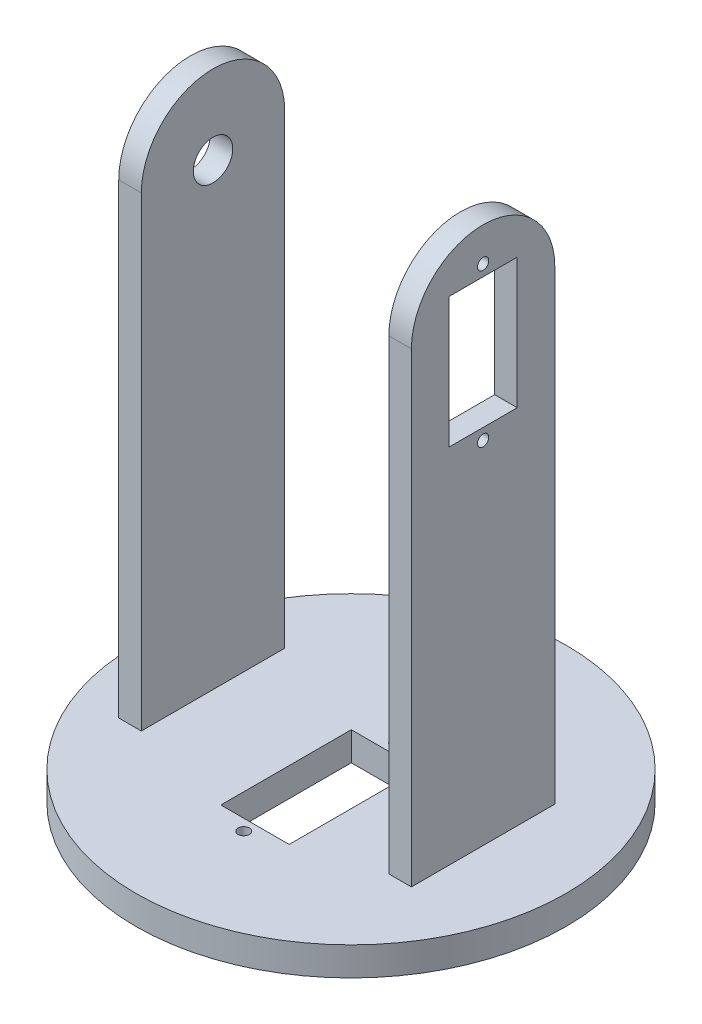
ISO-10303-21;
HEADER;
FILE_DESCRIPTION(('STEP AP214'),'2;1');
FILE_NAME('part.step','',(''),(''),'','','');
FILE_SCHEMA(('AUTOMOTIVE_DESIGN { 1 0 10303 214 1 1 1 1 }'));
ENDSEC;
DATA;
#1=APPLICATION_CONTEXT('core data for automotive mechanical design processes');
#2=APPLICATION_PROTOCOL_DEFINITION('international standard','automotive_design',2000,#1);
#3=PRODUCT_CONTEXT('',#1,'mechanical');
#4=PRODUCT('Part','Part','',(#3));
#5=PRODUCT_RELATED_PRODUCT_CATEGORY('part','',(#4));
#6=PRODUCT_DEFINITION_FORMATION('','',#4);
#7=PRODUCT_DEFINITION_CONTEXT('part definition',#1,'design');
#8=PRODUCT_DEFINITION('design','',#6,#7);
#9=PRODUCT_DEFINITION_SHAPE('','',#8);
#10=(LENGTH_UNIT() NAMED_UNIT(*) SI_UNIT(.MILLI.,.METRE.));
#11=(NAMED_UNIT(*) PLANE_ANGLE_UNIT() SI_UNIT($,.RADIAN.));
#12=(NAMED_UNIT(*) SI_UNIT($,.STERADIAN.) SOLID_ANGLE_UNIT());
#13=UNCERTAINTY_MEASURE_WITH_UNIT(LENGTH_MEASURE(1.E-05),#10,'distance_accuracy_value','');
#14=(GEOMETRIC_REPRESENTATION_CONTEXT(3) GLOBAL_UNCERTAINTY_ASSIGNED_CONTEXT((#13)) GLOBAL_UNIT_ASSIGNED_CONTEXT((#10,
#11,#12)) REPRESENTATION_CONTEXT('',''));
#15=CARTESIAN_POINT('',(0.,0.,0.));
#16=DIRECTION('',(0.,0.,1.));
#17=DIRECTION('',(1.,0.,0.));
#18=AXIS2_PLACEMENT_3D('',#15,#16,#17);
#19=CARTESIAN_POINT('',(-28.448,100.33,-12.7));
#20=DIRECTION('',(1.,0.,0.));
#21=DIRECTION('',(0.,0.,-1.));
#22=AXIS2_PLACEMENT_3D('',#19,#20,#21);
#23=PLANE('',#22);
#24=CARTESIAN_POINT('',(-28.448,86.33,0.));
#25=DIRECTION('',(-1.,0.,0.));
#26=DIRECTION('',(0.,0.,1.));
#27=AXIS2_PLACEMENT_3D('',#24,#25,#26);
#28=CIRCLE('',#27,3.5);
#29=CARTESIAN_POINT('',(-28.448,86.33,3.5));
#30=VERTEX_POINT('',#29);
#31=EDGE_CURVE('E164',#30,#30,#28,.T.);
#32=ORIENTED_EDGE('',*,*,#31,.F.);
#33=EDGE_LOOP('',(#32));
#34=FACE_BOUND('',#33,.T.);
#35=CARTESIAN_POINT('',(-28.448,87.63,0.));
#36=DIRECTION('',(1.,0.,0.));
#37=DIRECTION('',(0.,0.,-1.));
#38=AXIS2_PLACEMENT_3D('',#35,#36,#37);
#39=CIRCLE('',#38,12.7);
#40=CARTESIAN_POINT('',(-28.448,87.63,12.7));
#41=VERTEX_POINT('',#40);
#42=CARTESIAN_POINT('',(-28.448,87.63,-12.7));
#43=VERTEX_POINT('',#42);
#44=EDGE_CURVE('E206',#41,#43,#39,.F.);
#45=ORIENTED_EDGE('',*,*,#44,.T.);
#46=DIRECTION('',(0.,-1.,0.));
#47=VECTOR('',#46,1.);
#48=CARTESIAN_POINT('',(-28.448,100.33,-12.7));
#49=LINE('',#48,#47);
#50=CARTESIAN_POINT('',(-28.448,5.08,-12.7));
#51=VERTEX_POINT('',#50);
#52=EDGE_CURVE('E283',#43,#51,#49,.T.);
#53=ORIENTED_EDGE('',*,*,#52,.T.);
#54=DIRECTION('',(0.,0.,1.));
#55=VECTOR('',#54,1.);
#56=CARTESIAN_POINT('',(-28.448,5.08,-12.7));
#57=LINE('',#56,#55);
#58=CARTESIAN_POINT('',(-28.448,5.08,12.7));
#59=VERTEX_POINT('',#58);
#60=EDGE_CURVE('E271',#51,#59,#57,.T.);
#61=ORIENTED_EDGE('',*,*,#60,.T.);
#62=DIRECTION('',(0.,-1.,0.));
#63=VECTOR('',#62,1.);
#64=CARTESIAN_POINT('',(-28.448,100.33,12.7));
#65=LINE('',#64,#63);
#66=EDGE_CURVE('E289',#41,#59,#65,.T.);
#67=ORIENTED_EDGE('',*,*,#66,.F.);
#68=EDGE_LOOP('',(#45,#53,#61,#67));
#69=FACE_BOUND('',#68,.T.);
#70=ADVANCED_FACE('F37',(#34,#69),#23,.F.);
#71=CARTESIAN_POINT('',(-24.448,100.33,-12.7));
#72=DIRECTION('',(-1.,0.,0.));
#73=DIRECTION('',(0.,0.,1.));
#74=AXIS2_PLACEMENT_3D('',#71,#72,#73);
#75=PLANE('',#74);
#76=CARTESIAN_POINT('',(-24.448,86.33,0.));
#77=DIRECTION('',(-1.,0.,0.));
#78=DIRECTION('',(0.,0.,1.));
#79=AXIS2_PLACEMENT_3D('',#76,#77,#78);
#80=CIRCLE('',#79,3.5);
#81=CARTESIAN_POINT('',(-24.448,86.33,3.5));
#82=VERTEX_POINT('',#81);
#83=EDGE_CURVE('E189',#82,#82,#80,.F.);
#84=ORIENTED_EDGE('',*,*,#83,.F.);
#85=EDGE_LOOP('',(#84));
#86=FACE_BOUND('',#85,.T.);
#87=DIRECTION('',(0.,-1.,0.));
#88=VECTOR('',#87,1.);
#89=CARTESIAN_POINT('',(-24.448,100.33,-12.7));
#90=LINE('',#89,#88);
#91=CARTESIAN_POINT('',(-24.448,87.63,-12.7));
#92=VERTEX_POINT('',#91);
#93=CARTESIAN_POINT('',(-24.448,5.08,-12.7));
#94=VERTEX_POINT('',#93);
#95=EDGE_CURVE('E285',#92,#94,#90,.T.);
#96=ORIENTED_EDGE('',*,*,#95,.F.);
#97=CARTESIAN_POINT('',(-24.448,87.63,0.));
#98=DIRECTION('',(-1.,0.,0.));
#99=DIRECTION('',(0.,0.,1.));
#100=AXIS2_PLACEMENT_3D('',#97,#98,#99);
#101=CIRCLE('',#100,12.7);
#102=CARTESIAN_POINT('',(-24.448,87.63,12.7));
#103=VERTEX_POINT('',#102);
#104=EDGE_CURVE('E203',#92,#103,#101,.F.);
#105=ORIENTED_EDGE('',*,*,#104,.T.);
#106=DIRECTION('',(0.,-1.,0.));
#107=VECTOR('',#106,1.);
#108=CARTESIAN_POINT('',(-24.448,100.33,12.7));
#109=LINE('',#108,#107);
#110=CARTESIAN_POINT('',(-24.448,5.08,12.7));
#111=VERTEX_POINT('',#110);
#112=EDGE_CURVE('E287',#103,#111,#109,.T.);
#113=ORIENTED_EDGE('',*,*,#112,.T.);
#114=DIRECTION('',(0.,0.,-1.));
#115=VECTOR('',#114,1.);
#116=CARTESIAN_POINT('',(-24.448,5.08,-12.7));
#117=LINE('',#116,#115);
#118=EDGE_CURVE('E277',#111,#94,#117,.T.);
#119=ORIENTED_EDGE('',*,*,#118,.T.);
#120=EDGE_LOOP('',(#96,#105,#113,#119));
#121=FACE_BOUND('',#120,.T.);
#122=ADVANCED_FACE('F311',(#86,#121),#75,.F.);
#123=CARTESIAN_POINT('',(19.4,100.33,-12.7));
#124=DIRECTION('',(1.,0.,0.));
#125=DIRECTION('',(0.,0.,-1.));
#126=AXIS2_PLACEMENT_3D('',#123,#124,#125);
#127=PLANE('',#126);
#128=CARTESIAN_POINT('',(19.4,94.33,0.));
#129=DIRECTION('',(1.,0.,0.));
#130=DIRECTION('',(0.,0.,-1.));
#131=AXIS2_PLACEMENT_3D('',#128,#129,#130);
#132=CIRCLE('',#131,1.);
#133=CARTESIAN_POINT('',(19.4,94.33,-0.999999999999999));
#134=VERTEX_POINT('',#133);
#135=EDGE_CURVE('E208',#134,#134,#132,.F.);
#136=ORIENTED_EDGE('',*,*,#135,.F.);
#137=EDGE_LOOP('',(#136));
#138=FACE_BOUND('',#137,.T.);
#139=CARTESIAN_POINT('',(19.4,67.23,0.));
#140=DIRECTION('',(1.,0.,0.));
#141=DIRECTION('',(0.,0.,-1.));
#142=AXIS2_PLACEMENT_3D('',#139,#140,#141);
#143=CIRCLE('',#142,1.);
#144=CARTESIAN_POINT('',(19.4,67.23,-1.));
#145=VERTEX_POINT('',#144);
#146=EDGE_CURVE('E209',#145,#145,#143,.F.);
#147=ORIENTED_EDGE('',*,*,#146,.F.);
#148=EDGE_LOOP('',(#147));
#149=FACE_BOUND('',#148,.T.);
#150=DIRECTION('',(0.,1.,0.));
#151=VECTOR('',#150,1.);
#152=CARTESIAN_POINT('',(19.4,92.33,6.05));
#153=LINE('',#152,#151);
#154=CARTESIAN_POINT('',(19.4,69.23,6.05));
#155=VERTEX_POINT('',#154);
#156=CARTESIAN_POINT('',(19.4,92.33,6.05));
#157=VERTEX_POINT('',#156);
#158=EDGE_CURVE('E222',#155,#157,#153,.T.);
#159=ORIENTED_EDGE('',*,*,#158,.F.);
#160=DIRECTION('',(0.,0.,1.));
#161=VECTOR('',#160,1.);
#162=CARTESIAN_POINT('',(19.4,69.23,6.05));
#163=LINE('',#162,#161);
#164=CARTESIAN_POINT('',(19.4,69.23,-6.05));
#165=VERTEX_POINT('',#164);
#166=EDGE_CURVE('E216',#165,#155,#163,.T.);
#167=ORIENTED_EDGE('',*,*,#166,.F.);
#168=DIRECTION('',(0.,-1.,0.));
#169=VECTOR('',#168,1.);
#170=CARTESIAN_POINT('',(19.4,92.33,-6.05));
#171=LINE('',#170,#169);
#172=CARTESIAN_POINT('',(19.4,92.33,-6.05));
#173=VERTEX_POINT('',#172);
#174=EDGE_CURVE('E235',#173,#165,#171,.T.);
#175=ORIENTED_EDGE('',*,*,#174,.F.);
#176=DIRECTION('',(0.,0.,-1.));
#177=VECTOR('',#176,1.);
#178=CARTESIAN_POINT('',(19.4,92.33,6.05));
#179=LINE('',#178,#177);
#180=EDGE_CURVE('E238',#157,#173,#179,.T.);
#181=ORIENTED_EDGE('',*,*,#180,.F.);
#182=EDGE_LOOP('',(#159,#167,#175,#181));
#183=FACE_BOUND('',#182,.T.);
#184=CARTESIAN_POINT('',(19.4,87.63,0.));
#185=DIRECTION('',(1.,0.,0.));
#186=DIRECTION('',(0.,0.,-1.));
#187=AXIS2_PLACEMENT_3D('',#184,#185,#186);
#188=CIRCLE('',#187,12.7);
#189=CARTESIAN_POINT('',(19.4,87.63,12.7));
#190=VERTEX_POINT('',#189);
#191=CARTESIAN_POINT('',(19.4,87.63,-12.7));
#192=VERTEX_POINT('',#191);
#193=EDGE_CURVE('E201',#190,#192,#188,.F.);
#194=ORIENTED_EDGE('',*,*,#193,.T.);
#195=DIRECTION('',(0.,-1.,0.));
#196=VECTOR('',#195,1.);
#197=CARTESIAN_POINT('',(19.4,100.33,-12.7));
#198=LINE('',#197,#196);
#199=CARTESIAN_POINT('',(19.4,5.08,-12.7));
#200=VERTEX_POINT('',#199);
#201=EDGE_CURVE('E263',#192,#200,#198,.T.);
#202=ORIENTED_EDGE('',*,*,#201,.T.);
#203=DIRECTION('',(0.,0.,1.));
#204=VECTOR('',#203,1.);
#205=CARTESIAN_POINT('',(19.4,5.08,-12.7));
#206=LINE('',#205,#204);
#207=CARTESIAN_POINT('',(19.4,5.08,12.7));
#208=VERTEX_POINT('',#207);
#209=EDGE_CURVE('E251',#200,#208,#206,.T.);
#210=ORIENTED_EDGE('',*,*,#209,.T.);
#211=DIRECTION('',(0.,-1.,0.));
#212=VECTOR('',#211,1.);
#213=CARTESIAN_POINT('',(19.4,100.33,12.7));
#214=LINE('',#213,#212);
#215=EDGE_CURVE('E269',#190,#208,#214,.T.);
#216=ORIENTED_EDGE('',*,*,#215,.F.);
#217=EDGE_LOOP('',(#194,#202,#210,#216));
#218=FACE_BOUND('',#217,.T.);
#219=ADVANCED_FACE('F317',(#138,#149,#183,#218),#127,.F.);
#220=CARTESIAN_POINT('',(23.4,100.33,-12.7));
#221=DIRECTION('',(-1.,0.,0.));
#222=DIRECTION('',(0.,0.,1.));
#223=AXIS2_PLACEMENT_3D('',#220,#221,#222);
#224=PLANE('',#223);
#225=CARTESIAN_POINT('',(23.4,94.33,0.));
#226=DIRECTION('',(1.,0.,0.));
#227=DIRECTION('',(0.,0.,-1.));
#228=AXIS2_PLACEMENT_3D('',#225,#226,#227);
#229=CIRCLE('',#228,1.);
#230=CARTESIAN_POINT('',(23.4,94.33,-0.999999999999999));
#231=VERTEX_POINT('',#230);
#232=EDGE_CURVE('E213',#231,#231,#229,.T.);
#233=ORIENTED_EDGE('',*,*,#232,.F.);
#234=EDGE_LOOP('',(#233));
#235=FACE_BOUND('',#234,.T.);
#236=CARTESIAN_POINT('',(23.4,67.23,0.));
#237=DIRECTION('',(1.,0.,0.));
#238=DIRECTION('',(0.,0.,-1.));
#239=AXIS2_PLACEMENT_3D('',#236,#237,#238);
#240=CIRCLE('',#239,1.);
#241=CARTESIAN_POINT('',(23.4,67.23,-1.));
#242=VERTEX_POINT('',#241);
#243=EDGE_CURVE('E212',#242,#242,#240,.T.);
#244=ORIENTED_EDGE('',*,*,#243,.F.);
#245=EDGE_LOOP('',(#244));
#246=FACE_BOUND('',#245,.T.);
#247=DIRECTION('',(0.,1.,0.));
#248=VECTOR('',#247,1.);
#249=CARTESIAN_POINT('',(23.4,92.33,-6.05));
#250=LINE('',#249,#248);
#251=CARTESIAN_POINT('',(23.4,69.23,-6.05));
#252=VERTEX_POINT('',#251);
#253=CARTESIAN_POINT('',(23.4,92.33,-6.05));
#254=VERTEX_POINT('',#253);
#255=EDGE_CURVE('E226',#252,#254,#250,.T.);
#256=ORIENTED_EDGE('',*,*,#255,.F.);
#257=DIRECTION('',(0.,0.,-1.));
#258=VECTOR('',#257,1.);
#259=CARTESIAN_POINT('',(23.4,69.23,6.05));
#260=LINE('',#259,#258);
#261=CARTESIAN_POINT('',(23.4,69.23,6.05));
#262=VERTEX_POINT('',#261);
#263=EDGE_CURVE('E229',#262,#252,#260,.T.);
#264=ORIENTED_EDGE('',*,*,#263,.F.);
#265=DIRECTION('',(0.,-1.,0.));
#266=VECTOR('',#265,1.);
#267=CARTESIAN_POINT('',(23.4,92.33,6.05));
#268=LINE('',#267,#266);
#269=CARTESIAN_POINT('',(23.4,92.33,6.05));
#270=VERTEX_POINT('',#269);
#271=EDGE_CURVE('E232',#270,#262,#268,.T.);
#272=ORIENTED_EDGE('',*,*,#271,.F.);
#273=DIRECTION('',(0.,0.,1.));
#274=VECTOR('',#273,1.);
#275=CARTESIAN_POINT('',(23.4,92.33,6.05));
#276=LINE('',#275,#274);
#277=EDGE_CURVE('E223',#254,#270,#276,.T.);
#278=ORIENTED_EDGE('',*,*,#277,.F.);
#279=EDGE_LOOP('',(#256,#264,#272,#278));
#280=FACE_BOUND('',#279,.T.);
#281=DIRECTION('',(0.,-1.,0.));
#282=VECTOR('',#281,1.);
#283=CARTESIAN_POINT('',(23.4,100.33,-12.7));
#284=LINE('',#283,#282);
#285=CARTESIAN_POINT('',(23.4,87.63,-12.7));
#286=VERTEX_POINT('',#285);
#287=CARTESIAN_POINT('',(23.4,5.08,-12.7));
#288=VERTEX_POINT('',#287);
#289=EDGE_CURVE('E265',#286,#288,#284,.T.);
#290=ORIENTED_EDGE('',*,*,#289,.F.);
#291=CARTESIAN_POINT('',(23.4,87.63,0.));
#292=DIRECTION('',(1.,0.,0.));
#293=DIRECTION('',(0.,0.,-1.));
#294=AXIS2_PLACEMENT_3D('',#291,#292,#293);
#295=CIRCLE('',#294,12.7);
#296=CARTESIAN_POINT('',(23.4,87.63,12.7));
#297=VERTEX_POINT('',#296);
#298=EDGE_CURVE('E196',#297,#286,#295,.F.);
#299=ORIENTED_EDGE('',*,*,#298,.F.);
#300=DIRECTION('',(0.,-1.,0.));
#301=VECTOR('',#300,1.);
#302=CARTESIAN_POINT('',(23.4,100.33,12.7));
#303=LINE('',#302,#301);
#304=CARTESIAN_POINT('',(23.4,5.08,12.7));
#305=VERTEX_POINT('',#304);
#306=EDGE_CURVE('E267',#297,#305,#303,.T.);
#307=ORIENTED_EDGE('',*,*,#306,.T.);
#308=DIRECTION('',(0.,0.,-1.));
#309=VECTOR('',#308,1.);
#310=CARTESIAN_POINT('',(23.4,5.08,-12.7));
#311=LINE('',#310,#309);
#312=EDGE_CURVE('E257',#305,#288,#311,.T.);
#313=ORIENTED_EDGE('',*,*,#312,.T.);
#314=EDGE_LOOP('',(#290,#299,#307,#313));
#315=FACE_BOUND('',#314,.T.);
#316=ADVANCED_FACE('F361',(#235,#246,#280,#315),#224,.F.);
#317=CARTESIAN_POINT('',(-28.448,100.33,-12.7));
#318=DIRECTION('',(0.,0.,1.));
#319=DIRECTION('',(1.,0.,0.));
#320=AXIS2_PLACEMENT_3D('',#317,#318,#319);
#321=PLANE('',#320);
#322=DIRECTION('',(1.,0.,0.));
#323=VECTOR('',#322,1.);
#324=CARTESIAN_POINT('',(-38.1,87.63,-12.7));
#325=LINE('',#324,#323);
#326=EDGE_CURVE('E195',#43,#92,#325,.T.);
#327=ORIENTED_EDGE('',*,*,#326,.T.);
#328=ORIENTED_EDGE('',*,*,#95,.T.);
#329=DIRECTION('',(-1.,0.,0.));
#330=VECTOR('',#329,1.);
#331=CARTESIAN_POINT('',(-28.448,5.08,-12.7));
#332=LINE('',#331,#330);
#333=EDGE_CURVE('E280',#94,#51,#332,.T.);
#334=ORIENTED_EDGE('',*,*,#333,.T.);
#335=ORIENTED_EDGE('',*,*,#52,.F.);
#336=EDGE_LOOP('',(#327,#328,#334,#335));
#337=FACE_BOUND('',#336,.T.);
#338=ADVANCED_FACE('F328',(#337),#321,.F.);
#339=CARTESIAN_POINT('',(19.4,100.33,-12.7));
#340=DIRECTION('',(0.,0.,1.));
#341=DIRECTION('',(1.,0.,0.));
#342=AXIS2_PLACEMENT_3D('',#339,#340,#341);
#343=PLANE('',#342);
#344=EDGE_CURVE('E192',#192,#286,#325,.T.);
#345=ORIENTED_EDGE('',*,*,#344,.T.);
#346=ORIENTED_EDGE('',*,*,#289,.T.);
#347=DIRECTION('',(-1.,0.,0.));
#348=VECTOR('',#347,1.);
#349=CARTESIAN_POINT('',(19.4,5.08,-12.7));
#350=LINE('',#349,#348);
#351=EDGE_CURVE('E260',#288,#200,#350,.T.);
#352=ORIENTED_EDGE('',*,*,#351,.T.);
#353=ORIENTED_EDGE('',*,*,#201,.F.);
#354=EDGE_LOOP('',(#345,#346,#352,#353));
#355=FACE_BOUND('',#354,.T.);
#356=ADVANCED_FACE('F323',(#355),#343,.F.);
#357=CARTESIAN_POINT('',(0.,5.08,0.));
#358=DIRECTION('',(0.,1.,0.));
#359=DIRECTION('',(0.,0.,1.));
#360=AXIS2_PLACEMENT_3D('',#357,#358,#359);
#361=PLANE('',#360);
#362=CARTESIAN_POINT('',(0.,5.08,-8.096));
#363=DIRECTION('',(0.,1.,0.));
#364=DIRECTION('',(0.,0.,1.));
#365=AXIS2_PLACEMENT_3D('',#362,#363,#364);
#366=CIRCLE('',#365,1.);
#367=CARTESIAN_POINT('',(0.,5.08,-7.096));
#368=VERTEX_POINT('',#367);
#369=EDGE_CURVE('E334',#368,#368,#366,.T.);
#370=ORIENTED_EDGE('',*,*,#369,.F.);
#371=EDGE_LOOP('',(#370));
#372=FACE_BOUND('',#371,.T.);
#373=CARTESIAN_POINT('',(0.,5.08,19.004));
#374=DIRECTION('',(0.,1.,0.));
#375=DIRECTION('',(0.,0.,1.));
#376=AXIS2_PLACEMENT_3D('',#373,#374,#375);
#377=CIRCLE('',#376,1.);
#378=CARTESIAN_POINT('',(0.,5.08,20.004));
#379=VERTEX_POINT('',#378);
#380=EDGE_CURVE('E338',#379,#379,#377,.T.);
#381=ORIENTED_EDGE('',*,*,#380,.F.);
#382=EDGE_LOOP('',(#381));
#383=FACE_BOUND('',#382,.T.);
#384=DIRECTION('',(0.,0.,1.));
#385=VECTOR('',#384,1.);
#386=CARTESIAN_POINT('',(-6.05,5.08,-6.096));
#387=LINE('',#386,#385);
#388=CARTESIAN_POINT('',(-6.05,5.08,-6.096));
#389=VERTEX_POINT('',#388);
#390=CARTESIAN_POINT('',(-6.05000000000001,5.08,17.004));
#391=VERTEX_POINT('',#390);
#392=EDGE_CURVE('E52',#389,#391,#387,.T.);
#393=ORIENTED_EDGE('',*,*,#392,.F.);
#394=DIRECTION('',(-1.,0.,0.));
#395=VECTOR('',#394,1.);
#396=CARTESIAN_POINT('',(-6.05,5.08,-6.096));
#397=LINE('',#396,#395);
#398=CARTESIAN_POINT('',(6.05,5.08,-6.096));
#399=VERTEX_POINT('',#398);
#400=EDGE_CURVE('E158',#399,#389,#397,.T.);
#401=ORIENTED_EDGE('',*,*,#400,.F.);
#402=DIRECTION('',(0.,0.,-1.));
#403=VECTOR('',#402,1.);
#404=CARTESIAN_POINT('',(6.05,5.08,-6.096));
#405=LINE('',#404,#403);
#406=CARTESIAN_POINT('',(6.04999999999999,5.08,17.004));
#407=VERTEX_POINT('',#406);
#408=EDGE_CURVE('E178',#407,#399,#405,.T.);
#409=ORIENTED_EDGE('',*,*,#408,.F.);
#410=DIRECTION('',(1.,0.,0.));
#411=VECTOR('',#410,1.);
#412=CARTESIAN_POINT('',(-6.05000000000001,5.08,17.004));
#413=LINE('',#412,#411);
#414=EDGE_CURVE('E172',#391,#407,#413,.T.);
#415=ORIENTED_EDGE('',*,*,#414,.F.);
#416=EDGE_LOOP('',(#393,#401,#409,#415));
#417=FACE_BOUND('',#416,.T.);
#418=CARTESIAN_POINT('',(0.,5.08,0.));
#419=DIRECTION('',(0.,1.,0.));
#420=DIRECTION('',(0.,0.,1.));
#421=AXIS2_PLACEMENT_3D('',#418,#419,#420);
#422=CIRCLE('',#421,38.1);
#423=CARTESIAN_POINT('',(0.,5.08,38.1));
#424=VERTEX_POINT('',#423);
#425=EDGE_CURVE('E11',#424,#424,#422,.T.);
#426=ORIENTED_EDGE('',*,*,#425,.T.);
#427=EDGE_LOOP('',(#426));
#428=FACE_BOUND('',#427,.T.);
#429=DIRECTION('',(1.,0.,0.));
#430=VECTOR('',#429,1.);
#431=CARTESIAN_POINT('',(-28.448,5.08,12.7));
#432=LINE('',#431,#430);
#433=EDGE_CURVE('E274',#59,#111,#432,.T.);
#434=ORIENTED_EDGE('',*,*,#433,.F.);
#435=ORIENTED_EDGE('',*,*,#60,.F.);
#436=ORIENTED_EDGE('',*,*,#333,.F.);
#437=ORIENTED_EDGE('',*,*,#118,.F.);
#438=EDGE_LOOP('',(#434,#435,#436,#437));
#439=FACE_BOUND('',#438,.T.);
#440=DIRECTION('',(1.,0.,0.));
#441=VECTOR('',#440,1.);
#442=CARTESIAN_POINT('',(19.4,5.08,12.7));
#443=LINE('',#442,#441);
#444=EDGE_CURVE('E254',#208,#305,#443,.T.);
#445=ORIENTED_EDGE('',*,*,#444,.F.);
#446=ORIENTED_EDGE('',*,*,#209,.F.);
#447=ORIENTED_EDGE('',*,*,#351,.F.);
#448=ORIENTED_EDGE('',*,*,#312,.F.);
#449=EDGE_LOOP('',(#445,#446,#447,#448));
#450=FACE_BOUND('',#449,.T.);
#451=ADVANCED_FACE('F305',(#372,#383,#417,#428,#439,#450),#361,.T.);
#452=CARTESIAN_POINT('',(0.,5.08,0.));
#453=DIRECTION('',(0.,-1.,0.));
#454=DIRECTION('',(0.,0.,-1.));
#455=AXIS2_PLACEMENT_3D('',#452,#453,#454);
#456=CYLINDRICAL_SURFACE('',#455,38.1);
#457=ORIENTED_EDGE('',*,*,#425,.F.);
#458=EDGE_LOOP('',(#457));
#459=FACE_BOUND('',#458,.T.);
#460=CARTESIAN_POINT('',(0.,0.,0.));
#461=DIRECTION('',(0.,1.,0.));
#462=DIRECTION('',(0.,0.,1.));
#463=AXIS2_PLACEMENT_3D('',#460,#461,#462);
#464=CIRCLE('',#463,38.1);
#465=CARTESIAN_POINT('',(0.,0.,38.1));
#466=VERTEX_POINT('',#465);
#467=EDGE_CURVE('E41',#466,#466,#464,.T.);
#468=ORIENTED_EDGE('',*,*,#467,.T.);
#469=EDGE_LOOP('',(#468));
#470=FACE_BOUND('',#469,.T.);
#471=ADVANCED_FACE('F39',(#459,#470),#456,.T.);
#472=CARTESIAN_POINT('',(0.,0.,0.));
#473=DIRECTION('',(0.,1.,0.));
#474=DIRECTION('',(0.,0.,1.));
#475=AXIS2_PLACEMENT_3D('',#472,#473,#474);
#476=PLANE('',#475);
#477=CARTESIAN_POINT('',(0.,0.,-8.096));
#478=DIRECTION('',(0.,1.,0.));
#479=DIRECTION('',(0.,0.,1.));
#480=AXIS2_PLACEMENT_3D('',#477,#478,#479);
#481=CIRCLE('',#480,1.);
#482=CARTESIAN_POINT('',(0.,0.,-7.096));
#483=VERTEX_POINT('',#482);
#484=EDGE_CURVE('E538',#483,#483,#481,.F.);
#485=ORIENTED_EDGE('',*,*,#484,.F.);
#486=EDGE_LOOP('',(#485));
#487=FACE_BOUND('',#486,.T.);
#488=CARTESIAN_POINT('',(0.,0.,19.004));
#489=DIRECTION('',(0.,1.,0.));
#490=DIRECTION('',(0.,0.,1.));
#491=AXIS2_PLACEMENT_3D('',#488,#489,#490);
#492=CIRCLE('',#491,1.);
#493=CARTESIAN_POINT('',(0.,0.,20.004));
#494=VERTEX_POINT('',#493);
#495=EDGE_CURVE('E540',#494,#494,#492,.F.);
#496=ORIENTED_EDGE('',*,*,#495,.F.);
#497=EDGE_LOOP('',(#496));
#498=FACE_BOUND('',#497,.T.);
#499=DIRECTION('',(1.,0.,0.));
#500=VECTOR('',#499,1.);
#501=CARTESIAN_POINT('',(-6.05,0.,-6.096));
#502=LINE('',#501,#500);
#503=CARTESIAN_POINT('',(-6.05,0.,-6.096));
#504=VERTEX_POINT('',#503);
#505=CARTESIAN_POINT('',(6.05,0.,-6.096));
#506=VERTEX_POINT('',#505);
#507=EDGE_CURVE('E170',#504,#506,#502,.T.);
#508=ORIENTED_EDGE('',*,*,#507,.F.);
#509=DIRECTION('',(0.,0.,-1.));
#510=VECTOR('',#509,1.);
#511=CARTESIAN_POINT('',(-6.05,0.,-6.096));
#512=LINE('',#511,#510);
#513=CARTESIAN_POINT('',(-6.05000000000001,0.,17.004));
#514=VERTEX_POINT('',#513);
#515=EDGE_CURVE('E152',#514,#504,#512,.T.);
#516=ORIENTED_EDGE('',*,*,#515,.F.);
#517=DIRECTION('',(-1.,0.,0.));
#518=VECTOR('',#517,1.);
#519=CARTESIAN_POINT('',(-6.05000000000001,0.,17.004));
#520=LINE('',#519,#518);
#521=CARTESIAN_POINT('',(6.04999999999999,0.,17.004));
#522=VERTEX_POINT('',#521);
#523=EDGE_CURVE('E161',#522,#514,#520,.T.);
#524=ORIENTED_EDGE('',*,*,#523,.F.);
#525=DIRECTION('',(0.,0.,1.));
#526=VECTOR('',#525,1.);
#527=CARTESIAN_POINT('',(6.05,0.,-6.096));
#528=LINE('',#527,#526);
#529=EDGE_CURVE('E60',#506,#522,#528,.T.);
#530=ORIENTED_EDGE('',*,*,#529,.F.);
#531=EDGE_LOOP('',(#508,#516,#524,#530));
#532=FACE_BOUND('',#531,.T.);
#533=ORIENTED_EDGE('',*,*,#467,.F.);
#534=EDGE_LOOP('',(#533));
#535=FACE_BOUND('',#534,.T.);
#536=ADVANCED_FACE('F167',(#487,#498,#532,#535),#476,.F.);
#537=CARTESIAN_POINT('',(-28.448,100.33,12.7));
#538=DIRECTION('',(0.,0.,-1.));
#539=DIRECTION('',(-1.,0.,0.));
#540=AXIS2_PLACEMENT_3D('',#537,#538,#539);
#541=PLANE('',#540);
#542=ORIENTED_EDGE('',*,*,#112,.F.);
#543=DIRECTION('',(1.,0.,0.));
#544=VECTOR('',#543,1.);
#545=CARTESIAN_POINT('',(-38.1,87.63,12.7));
#546=LINE('',#545,#544);
#547=EDGE_CURVE('E200',#41,#103,#546,.T.);
#548=ORIENTED_EDGE('',*,*,#547,.F.);
#549=ORIENTED_EDGE('',*,*,#66,.T.);
#550=ORIENTED_EDGE('',*,*,#433,.T.);
#551=EDGE_LOOP('',(#542,#548,#549,#550));
#552=FACE_BOUND('',#551,.T.);
#553=ADVANCED_FACE('F297',(#552),#541,.F.);
#554=CARTESIAN_POINT('',(19.4,100.33,12.7));
#555=DIRECTION('',(0.,0.,-1.));
#556=DIRECTION('',(-1.,0.,0.));
#557=AXIS2_PLACEMENT_3D('',#554,#555,#556);
#558=PLANE('',#557);
#559=ORIENTED_EDGE('',*,*,#306,.F.);
#560=EDGE_CURVE('E198',#190,#297,#546,.T.);
#561=ORIENTED_EDGE('',*,*,#560,.F.);
#562=ORIENTED_EDGE('',*,*,#215,.T.);
#563=ORIENTED_EDGE('',*,*,#444,.T.);
#564=EDGE_LOOP('',(#559,#561,#562,#563));
#565=FACE_BOUND('',#564,.T.);
#566=ADVANCED_FACE('F303',(#565),#558,.F.);
#567=CARTESIAN_POINT('',(-38.101,69.23,6.05));
#568=DIRECTION('',(0.,-1.,0.));
#569=DIRECTION('',(0.,0.,-1.));
#570=AXIS2_PLACEMENT_3D('',#567,#568,#569);
#571=PLANE('',#570);
#572=ORIENTED_EDGE('',*,*,#166,.T.);
#573=DIRECTION('',(1.,0.,0.));
#574=VECTOR('',#573,1.);
#575=CARTESIAN_POINT('',(-38.101,69.23,6.05));
#576=LINE('',#575,#574);
#577=EDGE_CURVE('E246',#155,#262,#576,.T.);
#578=ORIENTED_EDGE('',*,*,#577,.T.);
#579=ORIENTED_EDGE('',*,*,#263,.T.);
#580=DIRECTION('',(1.,0.,0.));
#581=VECTOR('',#580,1.);
#582=CARTESIAN_POINT('',(-38.101,69.23,-6.05));
#583=LINE('',#582,#581);
#584=EDGE_CURVE('E225',#165,#252,#583,.T.);
#585=ORIENTED_EDGE('',*,*,#584,.F.);
#586=EDGE_LOOP('',(#572,#578,#579,#585));
#587=FACE_BOUND('',#586,.T.);
#588=ADVANCED_FACE('F394',(#587),#571,.F.);
#589=CARTESIAN_POINT('',(-38.101,92.33,-6.05));
#590=DIRECTION('',(0.,0.,-1.));
#591=DIRECTION('',(0.,1.,0.));
#592=AXIS2_PLACEMENT_3D('',#589,#590,#591);
#593=PLANE('',#592);
#594=ORIENTED_EDGE('',*,*,#174,.T.);
#595=ORIENTED_EDGE('',*,*,#584,.T.);
#596=ORIENTED_EDGE('',*,*,#255,.T.);
#597=DIRECTION('',(1.,0.,0.));
#598=VECTOR('',#597,1.);
#599=CARTESIAN_POINT('',(-38.101,92.33,-6.05));
#600=LINE('',#599,#598);
#601=EDGE_CURVE('E247',#173,#254,#600,.T.);
#602=ORIENTED_EDGE('',*,*,#601,.F.);
#603=EDGE_LOOP('',(#594,#595,#596,#602));
#604=FACE_BOUND('',#603,.T.);
#605=ADVANCED_FACE('F390',(#604),#593,.F.);
#606=CARTESIAN_POINT('',(-38.101,92.33,6.05));
#607=DIRECTION('',(0.,1.,0.));
#608=DIRECTION('',(0.,0.,1.));
#609=AXIS2_PLACEMENT_3D('',#606,#607,#608);
#610=PLANE('',#609);
#611=ORIENTED_EDGE('',*,*,#180,.T.);
#612=ORIENTED_EDGE('',*,*,#601,.T.);
#613=ORIENTED_EDGE('',*,*,#277,.T.);
#614=DIRECTION('',(1.,0.,0.));
#615=VECTOR('',#614,1.);
#616=CARTESIAN_POINT('',(-38.101,92.33,6.05));
#617=LINE('',#616,#615);
#618=EDGE_CURVE('E243',#157,#270,#617,.T.);
#619=ORIENTED_EDGE('',*,*,#618,.F.);
#620=EDGE_LOOP('',(#611,#612,#613,#619));
#621=FACE_BOUND('',#620,.T.);
#622=ADVANCED_FACE('F386',(#621),#610,.F.);
#623=CARTESIAN_POINT('',(-38.101,92.33,6.05));
#624=DIRECTION('',(0.,0.,1.));
#625=DIRECTION('',(0.,-1.,0.));
#626=AXIS2_PLACEMENT_3D('',#623,#624,#625);
#627=PLANE('',#626);
#628=ORIENTED_EDGE('',*,*,#158,.T.);
#629=ORIENTED_EDGE('',*,*,#618,.T.);
#630=ORIENTED_EDGE('',*,*,#271,.T.);
#631=ORIENTED_EDGE('',*,*,#577,.F.);
#632=EDGE_LOOP('',(#628,#629,#630,#631));
#633=FACE_BOUND('',#632,.T.);
#634=ADVANCED_FACE('F381',(#633),#627,.F.);
#635=CARTESIAN_POINT('',(-38.101,67.23,0.));
#636=DIRECTION('',(1.,0.,0.));
#637=DIRECTION('',(0.,0.,-1.));
#638=AXIS2_PLACEMENT_3D('',#635,#636,#637);
#639=CYLINDRICAL_SURFACE('',#638,1.);
#640=ORIENTED_EDGE('',*,*,#243,.T.);
#641=EDGE_LOOP('',(#640));
#642=FACE_BOUND('',#641,.T.);
#643=ORIENTED_EDGE('',*,*,#146,.T.);
#644=EDGE_LOOP('',(#643));
#645=FACE_BOUND('',#644,.T.);
#646=ADVANCED_FACE('F374',(#642,#645),#639,.F.);
#647=CARTESIAN_POINT('',(-38.101,94.33,0.));
#648=DIRECTION('',(1.,0.,0.));
#649=DIRECTION('',(0.,0.,-1.));
#650=AXIS2_PLACEMENT_3D('',#647,#648,#649);
#651=CYLINDRICAL_SURFACE('',#650,1.);
#652=ORIENTED_EDGE('',*,*,#232,.T.);
#653=EDGE_LOOP('',(#652));
#654=FACE_BOUND('',#653,.T.);
#655=ORIENTED_EDGE('',*,*,#135,.T.);
#656=EDGE_LOOP('',(#655));
#657=FACE_BOUND('',#656,.T.);
#658=ADVANCED_FACE('F366',(#654,#657),#651,.F.);
#659=CARTESIAN_POINT('',(-38.1,87.63,0.));
#660=DIRECTION('',(1.,0.,0.));
#661=DIRECTION('',(0.,0.,-1.));
#662=AXIS2_PLACEMENT_3D('',#659,#660,#661);
#663=CYLINDRICAL_SURFACE('',#662,12.7);
#664=ORIENTED_EDGE('',*,*,#560,.T.);
#665=ORIENTED_EDGE('',*,*,#298,.T.);
#666=ORIENTED_EDGE('',*,*,#344,.F.);
#667=ORIENTED_EDGE('',*,*,#193,.F.);
#668=EDGE_LOOP('',(#664,#665,#666,#667));
#669=FACE_BOUND('',#668,.T.);
#670=ADVANCED_FACE('F363',(#669),#663,.T.);
#671=ORIENTED_EDGE('',*,*,#547,.T.);
#672=ORIENTED_EDGE('',*,*,#104,.F.);
#673=ORIENTED_EDGE('',*,*,#326,.F.);
#674=ORIENTED_EDGE('',*,*,#44,.F.);
#675=EDGE_LOOP('',(#671,#672,#673,#674));
#676=FACE_BOUND('',#675,.T.);
#677=ADVANCED_FACE('F365',(#676),#663,.T.);
#678=CARTESIAN_POINT('',(38.101,86.33,0.));
#679=DIRECTION('',(-1.,0.,0.));
#680=DIRECTION('',(0.,0.,1.));
#681=AXIS2_PLACEMENT_3D('',#678,#679,#680);
#682=CYLINDRICAL_SURFACE('',#681,3.5);
#683=CARTESIAN_POINT('',(-28.448,86.33,3.5));
#684=CARTESIAN_POINT('',(-28.4063333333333,86.33,3.5));
#685=CARTESIAN_POINT('',(-28.3646666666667,86.33,3.5));
#686=CARTESIAN_POINT('',(-28.2813333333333,86.33,3.5));
#687=CARTESIAN_POINT('',(-28.2396666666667,86.33,3.5));
#688=CARTESIAN_POINT('',(-28.1563333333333,86.33,3.5));
#689=CARTESIAN_POINT('',(-28.1146666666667,86.33,3.5));
#690=CARTESIAN_POINT('',(-28.0313333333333,86.33,3.5));
#691=CARTESIAN_POINT('',(-27.9896666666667,86.33,3.5));
#692=CARTESIAN_POINT('',(-27.9063333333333,86.33,3.5));
#693=CARTESIAN_POINT('',(-27.8646666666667,86.33,3.5));
#694=CARTESIAN_POINT('',(-27.7813333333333,86.33,3.5));
#695=CARTESIAN_POINT('',(-27.7396666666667,86.33,3.5));
#696=CARTESIAN_POINT('',(-27.6563333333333,86.33,3.5));
#697=CARTESIAN_POINT('',(-27.6146666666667,86.33,3.5));
#698=CARTESIAN_POINT('',(-27.5313333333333,86.33,3.5));
#699=CARTESIAN_POINT('',(-27.4896666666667,86.33,3.5));
#700=CARTESIAN_POINT('',(-27.4063333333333,86.33,3.5));
#701=CARTESIAN_POINT('',(-27.3646666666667,86.33,3.5));
#702=CARTESIAN_POINT('',(-27.2813333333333,86.33,3.5));
#703=CARTESIAN_POINT('',(-27.2396666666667,86.33,3.5));
#704=CARTESIAN_POINT('',(-27.1563333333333,86.33,3.5));
#705=CARTESIAN_POINT('',(-27.1146666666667,86.33,3.5));
#706=CARTESIAN_POINT('',(-27.0313333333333,86.33,3.5));
#707=CARTESIAN_POINT('',(-26.9896666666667,86.33,3.5));
#708=CARTESIAN_POINT('',(-26.9063333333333,86.33,3.5));
#709=CARTESIAN_POINT('',(-26.8646666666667,86.33,3.5));
#710=CARTESIAN_POINT('',(-26.7813333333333,86.33,3.5));
#711=CARTESIAN_POINT('',(-26.7396666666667,86.33,3.5));
#712=CARTESIAN_POINT('',(-26.6563333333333,86.33,3.5));
#713=CARTESIAN_POINT('',(-26.6146666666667,86.33,3.5));
#714=CARTESIAN_POINT('',(-26.5313333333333,86.33,3.5));
#715=CARTESIAN_POINT('',(-26.4896666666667,86.33,3.5));
#716=CARTESIAN_POINT('',(-26.4063333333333,86.33,3.5));
#717=CARTESIAN_POINT('',(-26.3646666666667,86.33,3.5));
#718=CARTESIAN_POINT('',(-26.2813333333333,86.33,3.5));
#719=CARTESIAN_POINT('',(-26.2396666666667,86.33,3.5));
#720=CARTESIAN_POINT('',(-26.1563333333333,86.33,3.5));
#721=CARTESIAN_POINT('',(-26.1146666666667,86.33,3.5));
#722=CARTESIAN_POINT('',(-26.0313333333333,86.33,3.5));
#723=CARTESIAN_POINT('',(-25.9896666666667,86.33,3.5));
#724=CARTESIAN_POINT('',(-25.9063333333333,86.33,3.5));
#725=CARTESIAN_POINT('',(-25.8646666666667,86.33,3.5));
#726=CARTESIAN_POINT('',(-25.7813333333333,86.33,3.5));
#727=CARTESIAN_POINT('',(-25.7396666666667,86.33,3.5));
#728=CARTESIAN_POINT('',(-25.6563333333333,86.33,3.5));
#729=CARTESIAN_POINT('',(-25.6146666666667,86.33,3.5));
#730=CARTESIAN_POINT('',(-25.5313333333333,86.33,3.5));
#731=CARTESIAN_POINT('',(-25.4896666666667,86.33,3.5));
#732=CARTESIAN_POINT('',(-25.4063333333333,86.33,3.5));
#733=CARTESIAN_POINT('',(-25.3646666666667,86.33,3.5));
#734=CARTESIAN_POINT('',(-25.2813333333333,86.33,3.5));
#735=CARTESIAN_POINT('',(-25.2396666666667,86.33,3.5));
#736=CARTESIAN_POINT('',(-25.1563333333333,86.33,3.5));
#737=CARTESIAN_POINT('',(-25.1146666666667,86.33,3.5));
#738=CARTESIAN_POINT('',(-25.0313333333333,86.33,3.5));
#739=CARTESIAN_POINT('',(-24.9896666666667,86.33,3.5));
#740=CARTESIAN_POINT('',(-24.9063333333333,86.33,3.5));
#741=CARTESIAN_POINT('',(-24.8646666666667,86.33,3.5));
#742=CARTESIAN_POINT('',(-24.7813333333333,86.33,3.5));
#743=CARTESIAN_POINT('',(-24.7396666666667,86.33,3.5));
#744=CARTESIAN_POINT('',(-24.6563333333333,86.33,3.5));
#745=CARTESIAN_POINT('',(-24.6146666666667,86.33,3.5));
#746=CARTESIAN_POINT('',(-24.5313333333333,86.33,3.5));
#747=CARTESIAN_POINT('',(-24.4896666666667,86.33,3.5));
#748=CARTESIAN_POINT('',(-24.448,86.33,3.5));
#749=B_SPLINE_CURVE_WITH_KNOTS('',3,(#683,#684,#685,#686,#687,#688,#689,#690,#691,#692,#693,
#694,#695,#696,#697,#698,#699,#700,#701,#702,#703,#704,#705,#706,#707,#708,#709,#710,#711,#712,
#713,#714,#715,#716,#717,#718,#719,#720,#721,#722,#723,#724,#725,#726,#727,#728,#729,#730,#731,
#732,#733,#734,#735,#736,#737,#738,#739,#740,#741,#742,#743,#744,#745,#746,#747,#748),
.UNSPECIFIED.,.F.,.F.,(4,2,2,2,2,2,2,2,2,2,2,2,2,2,2,2,2,2,2,2,2,2,2,2,2,2,2,2,2,2,2,2,4),(0.,
0.125,0.25,0.375,0.5,0.625000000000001,0.750000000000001,0.875000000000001,1.,1.125,1.25,1.375,
1.5,1.625,1.75,1.875,2.,2.125,2.25,2.375,2.5,2.625,2.75,2.875,3.,3.125,3.25,3.375,3.5,3.625,
3.75,3.875,4.),.UNSPECIFIED.);
#750=EDGE_CURVE('BSEAM372',#30,#82,#749,.T.);
#751=ORIENTED_EDGE('',*,*,#31,.T.);
#752=ORIENTED_EDGE('',*,*,#83,.T.);
#753=ORIENTED_EDGE('',*,*,#750,.T.);
#754=ORIENTED_EDGE('',*,*,#750,.F.);
#755=EDGE_LOOP('',(#751,#753,#752,#754));
#756=FACE_BOUND('',#755,.T.);
#757=ADVANCED_FACE('F372',(#756),#682,.F.);
#758=CARTESIAN_POINT('',(-6.05,-0.00100000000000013,-6.096));
#759=DIRECTION('',(-1.,0.,0.));
#760=DIRECTION('',(0.,0.,1.));
#761=AXIS2_PLACEMENT_3D('',#758,#759,#760);
#762=PLANE('',#761);
#763=ORIENTED_EDGE('',*,*,#515,.T.);
#764=DIRECTION('',(0.,1.,0.));
#765=VECTOR('',#764,1.);
#766=CARTESIAN_POINT('',(-6.05,-0.00100000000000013,-6.096));
#767=LINE('',#766,#765);
#768=EDGE_CURVE('E165',#504,#389,#767,.T.);
#769=ORIENTED_EDGE('',*,*,#768,.T.);
#770=ORIENTED_EDGE('',*,*,#392,.T.);
#771=DIRECTION('',(0.,1.,0.));
#772=VECTOR('',#771,1.);
#773=CARTESIAN_POINT('',(-6.05000000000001,-0.00100000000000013,17.004));
#774=LINE('',#773,#772);
#775=EDGE_CURVE('E148',#514,#391,#774,.T.);
#776=ORIENTED_EDGE('',*,*,#775,.F.);
#777=EDGE_LOOP('',(#763,#769,#770,#776));
#778=FACE_BOUND('',#777,.T.);
#779=ADVANCED_FACE('F150',(#778),#762,.F.);
#780=CARTESIAN_POINT('',(-6.05,-0.00100000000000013,-6.096));
#781=DIRECTION('',(0.,0.,-1.));
#782=DIRECTION('',(-1.,0.,0.));
#783=AXIS2_PLACEMENT_3D('',#780,#781,#782);
#784=PLANE('',#783);
#785=ORIENTED_EDGE('',*,*,#507,.T.);
#786=DIRECTION('',(0.,1.,0.));
#787=VECTOR('',#786,1.);
#788=CARTESIAN_POINT('',(6.05,-0.00100000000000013,-6.096));
#789=LINE('',#788,#787);
#790=EDGE_CURVE('E184',#506,#399,#789,.T.);
#791=ORIENTED_EDGE('',*,*,#790,.T.);
#792=ORIENTED_EDGE('',*,*,#400,.T.);
#793=ORIENTED_EDGE('',*,*,#768,.F.);
#794=EDGE_LOOP('',(#785,#791,#792,#793));
#795=FACE_BOUND('',#794,.T.);
#796=ADVANCED_FACE('F487',(#795),#784,.F.);
#797=CARTESIAN_POINT('',(6.05,-0.00100000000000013,-6.096));
#798=DIRECTION('',(1.,0.,0.));
#799=DIRECTION('',(0.,0.,-1.));
#800=AXIS2_PLACEMENT_3D('',#797,#798,#799);
#801=PLANE('',#800);
#802=ORIENTED_EDGE('',*,*,#529,.T.);
#803=DIRECTION('',(0.,1.,0.));
#804=VECTOR('',#803,1.);
#805=CARTESIAN_POINT('',(6.04999999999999,-0.00100000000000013,17.004));
#806=LINE('',#805,#804);
#807=EDGE_CURVE('E157',#522,#407,#806,.T.);
#808=ORIENTED_EDGE('',*,*,#807,.T.);
#809=ORIENTED_EDGE('',*,*,#408,.T.);
#810=ORIENTED_EDGE('',*,*,#790,.F.);
#811=EDGE_LOOP('',(#802,#808,#809,#810));
#812=FACE_BOUND('',#811,.T.);
#813=ADVANCED_FACE('F495',(#812),#801,.F.);
#814=CARTESIAN_POINT('',(-6.05000000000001,-0.00100000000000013,17.004));
#815=DIRECTION('',(0.,0.,1.));
#816=DIRECTION('',(1.,0.,0.));
#817=AXIS2_PLACEMENT_3D('',#814,#815,#816);
#818=PLANE('',#817);
#819=ORIENTED_EDGE('',*,*,#523,.T.);
#820=ORIENTED_EDGE('',*,*,#775,.T.);
#821=ORIENTED_EDGE('',*,*,#414,.T.);
#822=ORIENTED_EDGE('',*,*,#807,.F.);
#823=EDGE_LOOP('',(#819,#820,#821,#822));
#824=FACE_BOUND('',#823,.T.);
#825=ADVANCED_FACE('F162',(#824),#818,.F.);
#826=CARTESIAN_POINT('',(0.,-0.00100000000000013,19.004));
#827=DIRECTION('',(0.,1.,0.));
#828=DIRECTION('',(0.,0.,1.));
#829=AXIS2_PLACEMENT_3D('',#826,#827,#828);
#830=CYLINDRICAL_SURFACE('',#829,1.);
#831=ORIENTED_EDGE('',*,*,#380,.T.);
#832=EDGE_LOOP('',(#831));
#833=FACE_BOUND('',#832,.T.);
#834=ORIENTED_EDGE('',*,*,#495,.T.);
#835=EDGE_LOOP('',(#834));
#836=FACE_BOUND('',#835,.T.);
#837=ADVANCED_FACE('F513',(#833,#836),#830,.F.);
#838=CARTESIAN_POINT('',(0.,-0.00100000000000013,-8.096));
#839=DIRECTION('',(0.,1.,0.));
#840=DIRECTION('',(0.,0.,1.));
#841=AXIS2_PLACEMENT_3D('',#838,#839,#840);
#842=CYLINDRICAL_SURFACE('',#841,1.);
#843=ORIENTED_EDGE('',*,*,#369,.T.);
#844=EDGE_LOOP('',(#843));
#845=FACE_BOUND('',#844,.T.);
#846=ORIENTED_EDGE('',*,*,#484,.T.);
#847=EDGE_LOOP('',(#846));
#848=FACE_BOUND('',#847,.T.);
#849=ADVANCED_FACE('F522',(#845,#848),#842,.F.);
#850=CLOSED_SHELL('',(#70,#122,#219,#316,#338,#356,#451,#471,#536,#553,#566,#588,#605,#622,#634,
#646,#658,#670,#677,#757,#779,#796,#813,#825,#837,#849));
#851=MANIFOLD_SOLID_BREP('B2',#850);
#852=ADVANCED_BREP_SHAPE_REPRESENTATION('',(#18,#851),#14);
#853=SHAPE_DEFINITION_REPRESENTATION(#9,#852);
ENDSEC;
END-ISO-10303-21;
